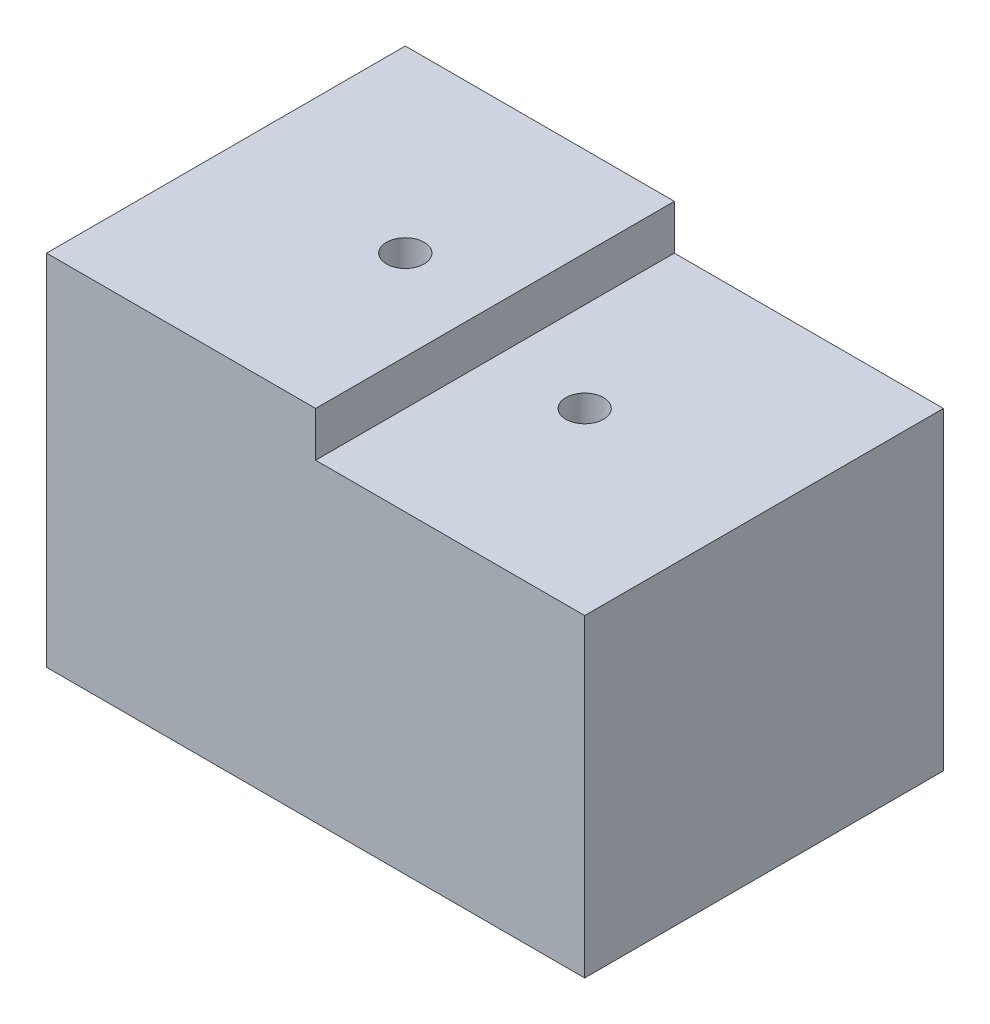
from build123d import *

# Parameters (mm, degrees)
SKIZZE1_W                       = 60
SKIZZE1_H                       = 40
LINEAR_AUSTRAGEN1_DEPTH         = 40
M5X0_8_GEWINDEKERNLOCH1_D       = 4.2
M5X0_8_GEWINDEKERNLOCH1_DEPTH   = 20
M5X0_8_GEWINDEKERNLOCH1_TIP     = 1.2618073
SKIZZE4_W                       = 30
SKIZZE4_H                       = 40
SCHNITT_LINEAR_AUSTRAGEN1_DEPTH = 5


with BuildPart() as part:
    # Skizze1 → Linear austragen1 (new body)
    with BuildSketch(Plane(origin=(0, 0, 0), x_dir=(1, 0, 0), z_dir=(0, 1, 0))):
        with Locations((30, 20)):
            Rectangle(SKIZZE1_W, SKIZZE1_H)
    extrude(amount=LINEAR_AUSTRAGEN1_DEPTH)

    # M5x0.8 Gewindekernloch1
    with Locations(Plane(origin=(0, 40, 0), x_dir=(-1, 0, 0), z_dir=(0, 1, 0))):
        with Locations((-20, -20), (-40, -20)):
            Hole(M5X0_8_GEWINDEKERNLOCH1_D / 2, depth=M5X0_8_GEWINDEKERNLOCH1_DEPTH)
            with Locations((0, 0, -(M5X0_8_GEWINDEKERNLOCH1_DEPTH + M5X0_8_GEWINDEKERNLOCH1_TIP / 2))):  # 118° drill point
                Cone(0, M5X0_8_GEWINDEKERNLOCH1_D / 2, M5X0_8_GEWINDEKERNLOCH1_TIP, mode=Mode.SUBTRACT)

    # Skizze4 → Schnitt-Linear austragen1 (cut)
    with BuildSketch(Plane(origin=(0, 40, 0), x_dir=(-1, 0, 0), z_dir=(0, 1, 0))):
        with Locations((-45, -20)):
            Rectangle(SKIZZE4_W, SKIZZE4_H)
    extrude(amount=-SCHNITT_LINEAR_AUSTRAGEN1_DEPTH, mode=Mode.SUBTRACT)


solid = part.part
